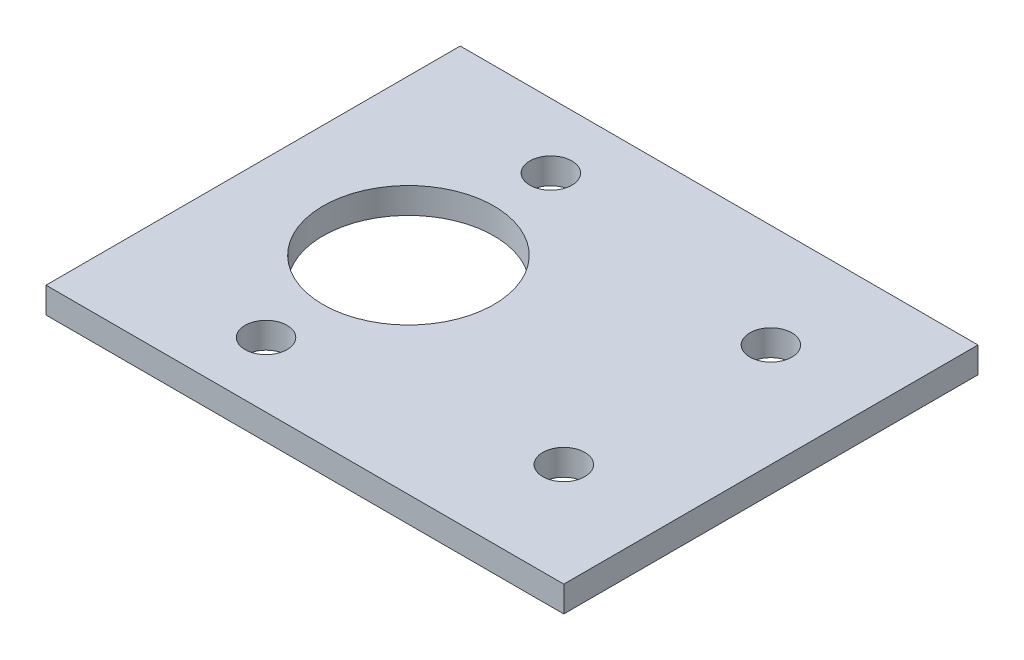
from build123d import *

# Parameters (mm, degrees)
SKETCH5_W          = 254
SKETCH5_H          = 203.2
EXTRUDE1_DEPTH     = 12.7
SKETCH6_R          = 10.31875
CUT_EXTRUDE1_DEPTH = 12.7
SKETCH7_R          = 10.31875
CUT_EXTRUDE3_DEPTH = 12.7
SKETCH8_R          = 41.91
CUT_EXTRUDE4_DEPTH = 12.7
SKETCH13_R         = 10.31875
CUT_EXTRUDE5_DEPTH = 12.7


with BuildPart() as part:
    # Sketch5 → Extrude1 (new body)
    with BuildSketch(Plane(origin=(0, 0, 0), x_dir=(1, 0, 0), z_dir=(0, 1, 0))):
        with Locations((-127, -101.6)):
            Rectangle(SKETCH5_W, SKETCH5_H)
    extrude(amount=EXTRUDE1_DEPTH)

    # Sketch6 → Cut-Extrude1 (cut)
    with BuildSketch(Plane(origin=(0, 12.7, 0), x_dir=(1, 0, 0), z_dir=(0, 1, 0))):
        with Locations(Location((-50.8, -50.8, 0), (0, 0, 270))):
            Circle(SKETCH6_R)
    extrude(amount=-CUT_EXTRUDE1_DEPTH, mode=Mode.SUBTRACT)

    # Sketch7 → Cut-Extrude3 (cut)
    with BuildSketch(Plane(origin=(0, 12.7, 0), x_dir=(1, 0, 0), z_dir=(0, 1, 0))):
        with Locations(Location((-50.8, -152.4, 0), (0, 0, 270))):
            Circle(SKETCH7_R)
    extrude(amount=-CUT_EXTRUDE3_DEPTH, mode=Mode.SUBTRACT)

    # Sketch8 → Cut-Extrude4 (cut)
    with BuildSketch(Plane(origin=(0, 12.7, 0), x_dir=(1, 0, 0), z_dir=(0, 1, 0))):
        with Locations(Location((-177.8, -101.6, 0), (0, 0, 270))):
            Circle(SKETCH8_R)
    extrude(amount=-CUT_EXTRUDE4_DEPTH, mode=Mode.SUBTRACT)

    # Sketch13 → Cut-Extrude5 (cut)
    with BuildSketch(Plane(origin=(0, 12.7, 0), x_dir=(1, 0, 0), z_dir=(0, 1, 0))):
        with Locations(Location((-177.8, -171.45, 0), (0, 0, 270))):
            Circle(SKETCH13_R)
        with Locations(Location((-177.8, -31.75, 0), (0, 0, 270))):
            Circle(SKETCH13_R)
    extrude(amount=-CUT_EXTRUDE5_DEPTH, mode=Mode.SUBTRACT)


solid = part.part
